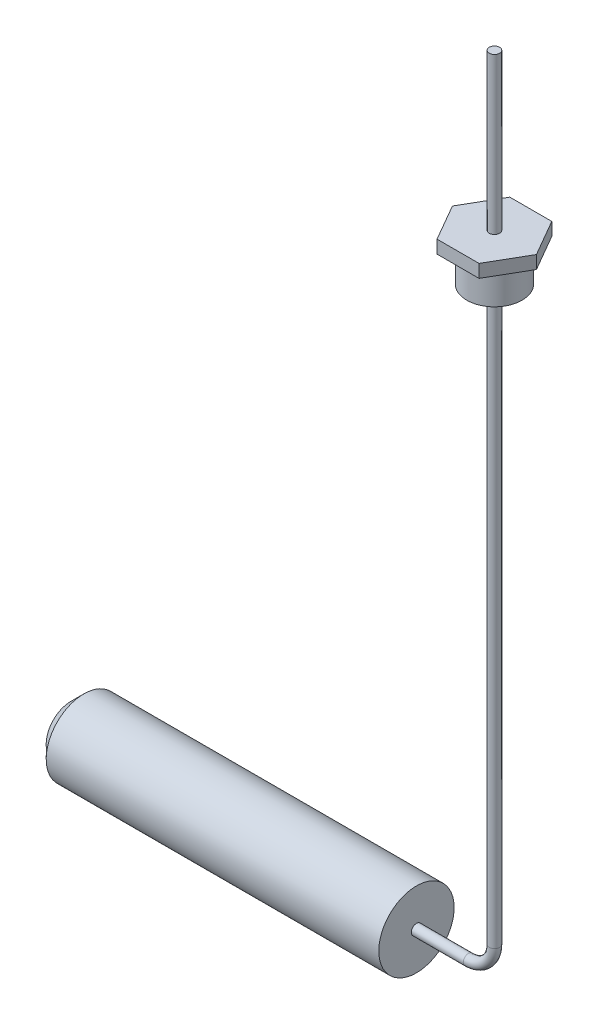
from build123d import *

# Parameters (mm, degrees)
ESQUISSE2_R      = 2
ESQUISSE3_R      = 10.65
EXTRUSION1_DEPTH = 13
EXTRUSION2_DEPTH = 5
ESQUISSE5_R      = 2
EXTRUSION3_DEPTH = 60
ESQUISSE6_R      = 14.5
EXTRUSION4_DEPTH = 133
CHANFREIN1_SIZE  = 5


with BuildPart() as part:
    # Balayage1: sweep along a path in Esquisse1
    with BuildLine(Plane.XY) as balayage1_path:
        Line((0, 0), (0, -220))
        ThreePointArc((0, -220), (-2.928932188, -227.071067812), (-10, -230))
        Line((-10, -230), (-30, -230))
    # Esquisse2 → Balayage1 (sweep)
    with BuildSketch(Plane(origin=(0, 0, 0), x_dir=(1, 0, 0), z_dir=(0, 1, 0))):
        Circle(ESQUISSE2_R)
    sweep(path=balayage1_path.line)

    # Esquisse3 → Extrusion1 (add)
    with BuildSketch(Plane(origin=(0, 0, 0), x_dir=(-1, 0, 0), z_dir=(0, 1, 0))):
        with Locations(Location((0, 0, 0), (0, 0, 270))):
            Circle(ESQUISSE3_R)
    extrude(amount=EXTRUSION1_DEPTH)

    # Esquisse4 → Extrusion2 (add)
    with BuildSketch(Plane(origin=(0, 13, 0), x_dir=(-1, 0, 0), z_dir=(0, 1, 0))):
        Polygon((8.082903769, 14), (-8.082903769, 14), (-16.165807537, 0), (-8.082903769, -14), (8.082903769, -14), (16.165807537, 0), align=None)
    extrude(amount=EXTRUSION2_DEPTH)

    # Esquisse5 → Extrusion3 (add)
    with BuildSketch(Plane(origin=(0, 18, 0), x_dir=(-1, 0, 0), z_dir=(0, 1, 0))):
        with Locations(Location((0, 0, 0), (0, 0, 90))):
            Circle(ESQUISSE5_R)
    extrude(amount=EXTRUSION3_DEPTH)

    # Esquisse6 → Extrusion4 (add)
    with BuildSketch(Plane.ZY.offset(30)):
        with Locations(Location((0, -230, 0), (0, 0, 270))):
            Circle(ESQUISSE6_R)
    extrude(amount=EXTRUSION4_DEPTH)

    # Chanfrein1
    chanfrein1_edges = [part.edges().sort_by_distance(p)[0] for p in [
        (-163, -215.5, 0),
    ]]
    chamfer(chanfrein1_edges, length=CHANFREIN1_SIZE)


solid = part.part
